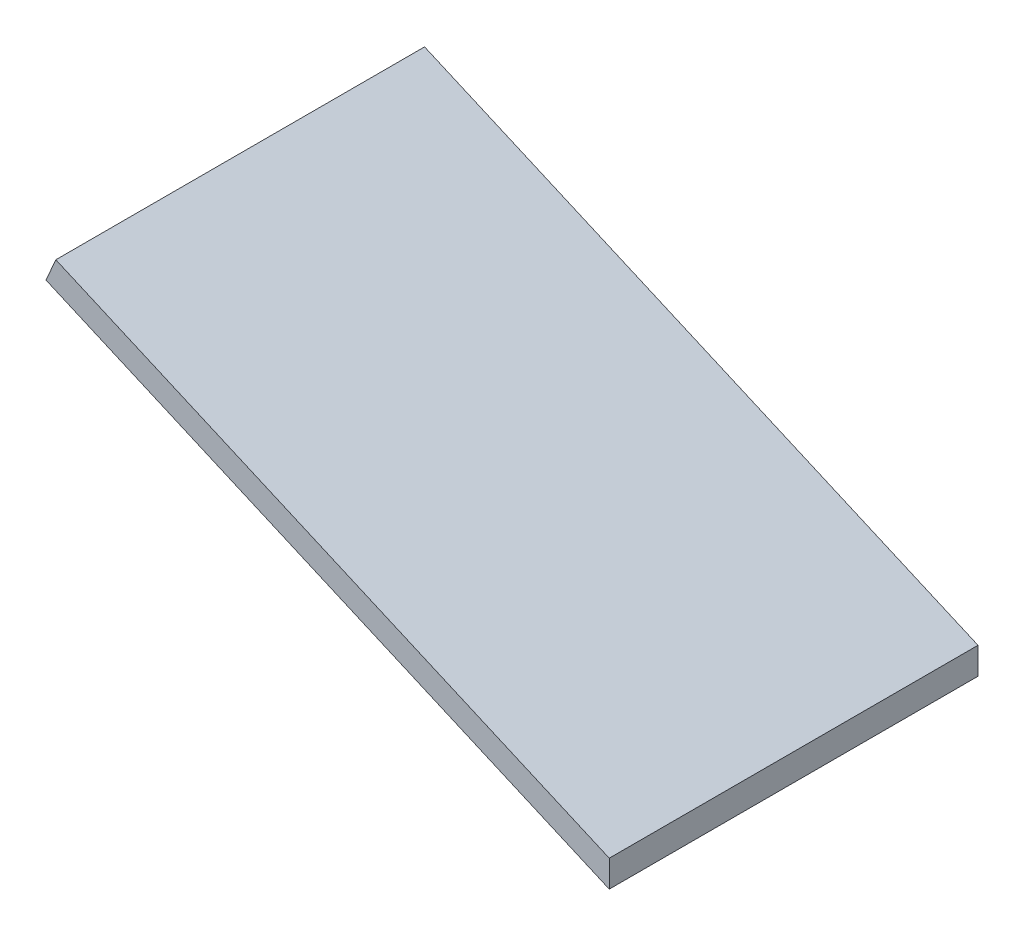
ISO-10303-21;
HEADER;
FILE_DESCRIPTION(('STEP AP214'),'2;1');
FILE_NAME('part.step','',(''),(''),'','','');
FILE_SCHEMA(('AUTOMOTIVE_DESIGN { 1 0 10303 214 1 1 1 1 }'));
ENDSEC;
DATA;
#1=APPLICATION_CONTEXT('core data for automotive mechanical design processes');
#2=APPLICATION_PROTOCOL_DEFINITION('international standard','automotive_design',2000,#1);
#3=PRODUCT_CONTEXT('',#1,'mechanical');
#4=PRODUCT('Part','Part','',(#3));
#5=PRODUCT_RELATED_PRODUCT_CATEGORY('part','',(#4));
#6=PRODUCT_DEFINITION_FORMATION('','',#4);
#7=PRODUCT_DEFINITION_CONTEXT('part definition',#1,'design');
#8=PRODUCT_DEFINITION('design','',#6,#7);
#9=PRODUCT_DEFINITION_SHAPE('','',#8);
#10=(LENGTH_UNIT() NAMED_UNIT(*) SI_UNIT(.MILLI.,.METRE.));
#11=(NAMED_UNIT(*) PLANE_ANGLE_UNIT() SI_UNIT($,.RADIAN.));
#12=(NAMED_UNIT(*) SI_UNIT($,.STERADIAN.) SOLID_ANGLE_UNIT());
#13=UNCERTAINTY_MEASURE_WITH_UNIT(LENGTH_MEASURE(1.E-05),#10,'distance_accuracy_value','');
#14=(GEOMETRIC_REPRESENTATION_CONTEXT(3) GLOBAL_UNCERTAINTY_ASSIGNED_CONTEXT((#13)) GLOBAL_UNIT_ASSIGNED_CONTEXT((#10,
#11,#12)) REPRESENTATION_CONTEXT('',''));
#15=CARTESIAN_POINT('',(0.,0.,0.));
#16=DIRECTION('',(0.,0.,1.));
#17=DIRECTION('',(1.,0.,0.));
#18=AXIS2_PLACEMENT_3D('',#15,#16,#17);
#19=CARTESIAN_POINT('',(-22.9128784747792,10.,30.));
#20=DIRECTION('',(0.916515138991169,-0.399999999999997,0.));
#21=DIRECTION('',(0.399999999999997,0.916515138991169,0.));
#22=AXIS2_PLACEMENT_3D('',#19,#20,#21);
#23=PLANE('',#22);
#24=DIRECTION('',(-0.399999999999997,-0.916515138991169,0.));
#25=VECTOR('',#24,1.);
#26=CARTESIAN_POINT('',(-22.9128784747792,10.,0.));
#27=LINE('',#26,#25);
#28=CARTESIAN_POINT('',(-22.1128784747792,11.8330302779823,0.));
#29=VERTEX_POINT('',#28);
#30=CARTESIAN_POINT('',(-22.9128784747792,10.,0.));
#31=VERTEX_POINT('',#30);
#32=EDGE_CURVE('E96',#29,#31,#27,.T.);
#33=ORIENTED_EDGE('',*,*,#32,.T.);
#34=DIRECTION('',(0.,0.,-1.));
#35=VECTOR('',#34,1.);
#36=CARTESIAN_POINT('',(-22.9128784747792,10.,30.));
#37=LINE('',#36,#35);
#38=CARTESIAN_POINT('',(-22.9128784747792,10.,30.));
#39=VERTEX_POINT('',#38);
#40=EDGE_CURVE('E11',#39,#31,#37,.T.);
#41=ORIENTED_EDGE('',*,*,#40,.F.);
#42=DIRECTION('',(-0.399999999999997,-0.916515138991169,0.));
#43=VECTOR('',#42,1.);
#44=CARTESIAN_POINT('',(-22.9128784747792,10.,30.));
#45=LINE('',#44,#43);
#46=CARTESIAN_POINT('',(-22.1128784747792,11.8330302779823,30.));
#47=VERTEX_POINT('',#46);
#48=EDGE_CURVE('E84',#47,#39,#45,.T.);
#49=ORIENTED_EDGE('',*,*,#48,.F.);
#50=DIRECTION('',(0.,0.,-1.));
#51=VECTOR('',#50,1.);
#52=CARTESIAN_POINT('',(-22.1128784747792,11.8330302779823,30.));
#53=LINE('',#52,#51);
#54=EDGE_CURVE('E92',#47,#29,#53,.T.);
#55=ORIENTED_EDGE('',*,*,#54,.T.);
#56=EDGE_LOOP('',(#33,#41,#49,#55));
#57=FACE_BOUND('',#56,.T.);
#58=ADVANCED_FACE('F33',(#57),#23,.F.);
#59=CARTESIAN_POINT('',(22.9128784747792,-10.,30.));
#60=DIRECTION('',(0.4,0.916515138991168,0.));
#61=DIRECTION('',(-0.916515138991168,0.4,0.));
#62=AXIS2_PLACEMENT_3D('',#59,#60,#61);
#63=PLANE('',#62);
#64=DIRECTION('',(0.916515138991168,-0.4,0.));
#65=VECTOR('',#64,1.);
#66=CARTESIAN_POINT('',(22.9128784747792,-10.,0.));
#67=LINE('',#66,#65);
#68=CARTESIAN_POINT('',(22.9128784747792,-10.,0.));
#69=VERTEX_POINT('',#68);
#70=EDGE_CURVE('E88',#31,#69,#67,.T.);
#71=ORIENTED_EDGE('',*,*,#70,.T.);
#72=DIRECTION('',(0.,0.,-1.));
#73=VECTOR('',#72,1.);
#74=CARTESIAN_POINT('',(22.9128784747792,-10.,30.));
#75=LINE('',#74,#73);
#76=CARTESIAN_POINT('',(22.9128784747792,-10.,30.));
#77=VERTEX_POINT('',#76);
#78=EDGE_CURVE('E41',#77,#69,#75,.T.);
#79=ORIENTED_EDGE('',*,*,#78,.F.);
#80=DIRECTION('',(0.916515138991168,-0.4,0.));
#81=VECTOR('',#80,1.);
#82=CARTESIAN_POINT('',(22.9128784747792,-10.,30.));
#83=LINE('',#82,#81);
#84=EDGE_CURVE('E79',#39,#77,#83,.T.);
#85=ORIENTED_EDGE('',*,*,#84,.F.);
#86=ORIENTED_EDGE('',*,*,#40,.T.);
#87=EDGE_LOOP('',(#71,#79,#85,#86));
#88=FACE_BOUND('',#87,.T.);
#89=ADVANCED_FACE('F87',(#88),#63,.F.);
#90=CARTESIAN_POINT('',(22.9128784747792,-10.,30.));
#91=DIRECTION('',(-1.,0.,0.));
#92=DIRECTION('',(0.,0.,1.));
#93=AXIS2_PLACEMENT_3D('',#90,#91,#92);
#94=PLANE('',#93);
#95=DIRECTION('',(0.,1.,0.));
#96=VECTOR('',#95,1.);
#97=CARTESIAN_POINT('',(22.9128784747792,-10.,0.));
#98=LINE('',#97,#96);
#99=CARTESIAN_POINT('',(22.9128784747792,-7.81782109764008,0.));
#100=VERTEX_POINT('',#99);
#101=EDGE_CURVE('E66',#69,#100,#98,.T.);
#102=ORIENTED_EDGE('',*,*,#101,.T.);
#103=DIRECTION('',(0.,0.,-1.));
#104=VECTOR('',#103,1.);
#105=CARTESIAN_POINT('',(22.9128784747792,-7.81782109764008,30.));
#106=LINE('',#105,#104);
#107=CARTESIAN_POINT('',(22.9128784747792,-7.81782109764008,30.));
#108=VERTEX_POINT('',#107);
#109=EDGE_CURVE('E89',#108,#100,#106,.T.);
#110=ORIENTED_EDGE('',*,*,#109,.F.);
#111=DIRECTION('',(0.,1.,0.));
#112=VECTOR('',#111,1.);
#113=CARTESIAN_POINT('',(22.9128784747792,-10.,30.));
#114=LINE('',#113,#112);
#115=EDGE_CURVE('E82',#77,#108,#114,.T.);
#116=ORIENTED_EDGE('',*,*,#115,.F.);
#117=ORIENTED_EDGE('',*,*,#78,.T.);
#118=EDGE_LOOP('',(#102,#110,#116,#117));
#119=FACE_BOUND('',#118,.T.);
#120=ADVANCED_FACE('F90',(#119),#94,.F.);
#121=CARTESIAN_POINT('',(22.9128784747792,-7.81782109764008,30.));
#122=DIRECTION('',(-0.4,-0.916515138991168,0.));
#123=DIRECTION('',(0.916515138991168,-0.4,0.));
#124=AXIS2_PLACEMENT_3D('',#121,#122,#123);
#125=PLANE('',#124);
#126=DIRECTION('',(-0.916515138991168,0.4,0.));
#127=VECTOR('',#126,1.);
#128=CARTESIAN_POINT('',(22.9128784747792,-7.81782109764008,0.));
#129=LINE('',#128,#127);
#130=EDGE_CURVE('E72',#100,#29,#129,.T.);
#131=ORIENTED_EDGE('',*,*,#130,.T.);
#132=ORIENTED_EDGE('',*,*,#54,.F.);
#133=DIRECTION('',(-0.916515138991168,0.4,0.));
#134=VECTOR('',#133,1.);
#135=CARTESIAN_POINT('',(22.9128784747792,-7.81782109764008,30.));
#136=LINE('',#135,#134);
#137=EDGE_CURVE('E49',#108,#47,#136,.T.);
#138=ORIENTED_EDGE('',*,*,#137,.F.);
#139=ORIENTED_EDGE('',*,*,#109,.T.);
#140=EDGE_LOOP('',(#131,#132,#138,#139));
#141=FACE_BOUND('',#140,.T.);
#142=ADVANCED_FACE('F103',(#141),#125,.F.);
#143=CARTESIAN_POINT('',(0.,0.,30.));
#144=DIRECTION('',(0.,0.,1.));
#145=DIRECTION('',(1.,0.,0.));
#146=AXIS2_PLACEMENT_3D('',#143,#144,#145);
#147=PLANE('',#146);
#148=ORIENTED_EDGE('',*,*,#48,.T.);
#149=ORIENTED_EDGE('',*,*,#84,.T.);
#150=ORIENTED_EDGE('',*,*,#115,.T.);
#151=ORIENTED_EDGE('',*,*,#137,.T.);
#152=EDGE_LOOP('',(#148,#149,#150,#151));
#153=FACE_BOUND('',#152,.T.);
#154=ADVANCED_FACE('F80',(#153),#147,.T.);
#155=CARTESIAN_POINT('',(0.,0.,0.));
#156=DIRECTION('',(0.,0.,1.));
#157=DIRECTION('',(1.,0.,0.));
#158=AXIS2_PLACEMENT_3D('',#155,#156,#157);
#159=PLANE('',#158);
#160=ORIENTED_EDGE('',*,*,#32,.F.);
#161=ORIENTED_EDGE('',*,*,#130,.F.);
#162=ORIENTED_EDGE('',*,*,#101,.F.);
#163=ORIENTED_EDGE('',*,*,#70,.F.);
#164=EDGE_LOOP('',(#160,#161,#162,#163));
#165=FACE_BOUND('',#164,.T.);
#166=ADVANCED_FACE('F106',(#165),#159,.F.);
#167=CLOSED_SHELL('',(#58,#89,#120,#142,#154,#166));
#168=MANIFOLD_SOLID_BREP('B2',#167);
#169=ADVANCED_BREP_SHAPE_REPRESENTATION('',(#18,#168),#14);
#170=SHAPE_DEFINITION_REPRESENTATION(#9,#169);
ENDSEC;
END-ISO-10303-21;
